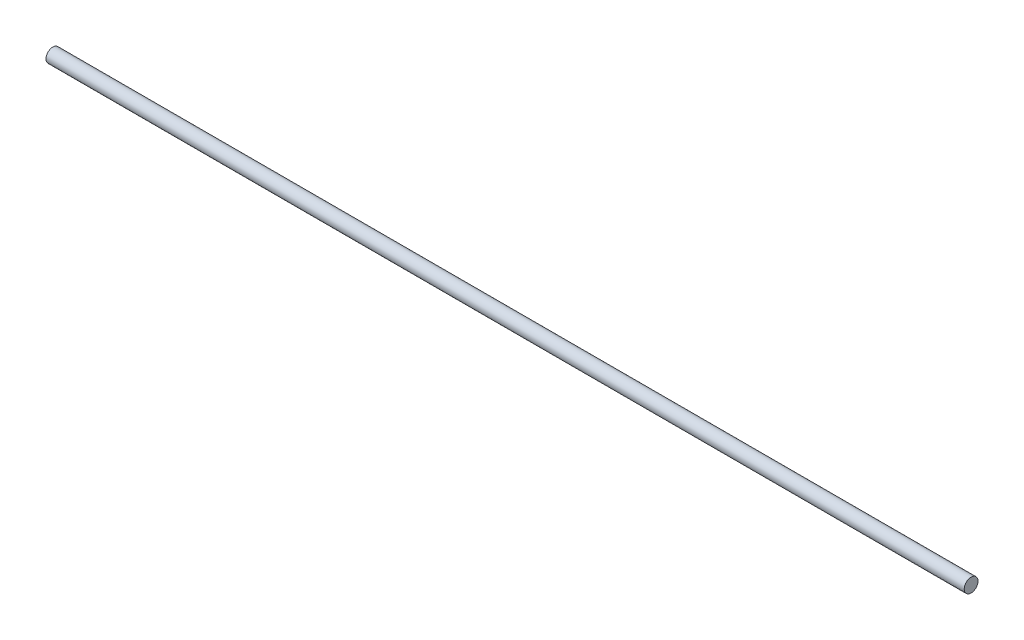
from build123d import *

# Parameters (mm, degrees)
SKETCH1_R           = 0.75
BOSS_EXTRUDE1_DEPTH = 100


with BuildPart() as part:
    # Sketch1 → Boss-Extrude1 (new body)
    with BuildSketch(Plane(origin=(0, 0, 0), x_dir=(0, 0, -1), z_dir=(1, 0, 0))):
        Circle(SKETCH1_R)
    extrude(amount=BOSS_EXTRUDE1_DEPTH)


solid = part.part
